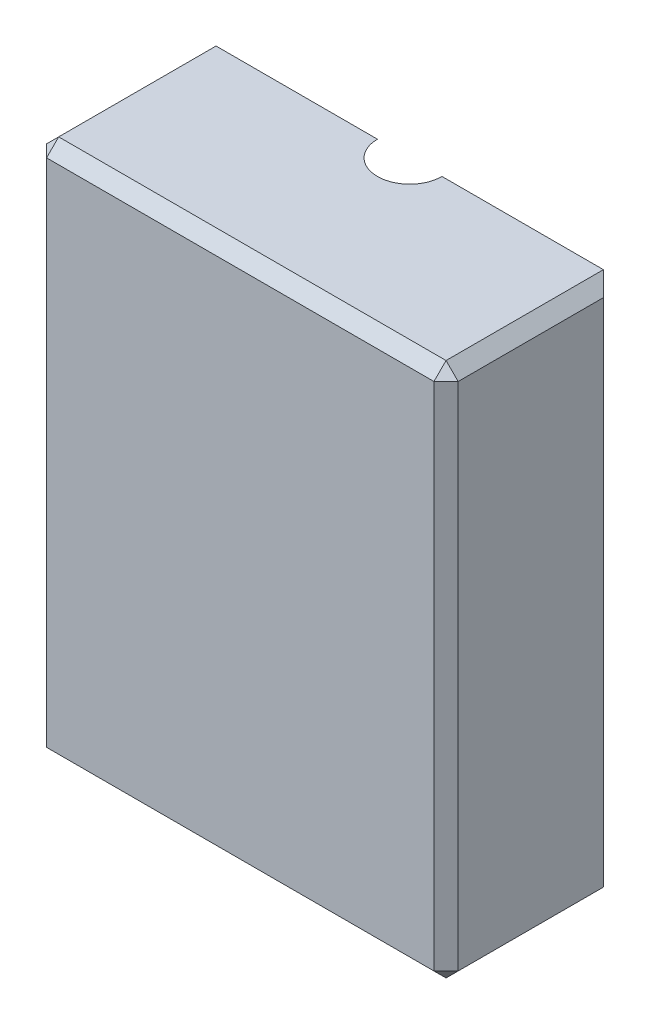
ISO-10303-21;
HEADER;
FILE_DESCRIPTION(('STEP AP214'),'2;1');
FILE_NAME('part.step','',(''),(''),'','','');
FILE_SCHEMA(('AUTOMOTIVE_DESIGN { 1 0 10303 214 1 1 1 1 }'));
ENDSEC;
DATA;
#1=APPLICATION_CONTEXT('core data for automotive mechanical design processes');
#2=APPLICATION_PROTOCOL_DEFINITION('international standard','automotive_design',2000,#1);
#3=PRODUCT_CONTEXT('',#1,'mechanical');
#4=PRODUCT('Part','Part','',(#3));
#5=PRODUCT_RELATED_PRODUCT_CATEGORY('part','',(#4));
#6=PRODUCT_DEFINITION_FORMATION('','',#4);
#7=PRODUCT_DEFINITION_CONTEXT('part definition',#1,'design');
#8=PRODUCT_DEFINITION('design','',#6,#7);
#9=PRODUCT_DEFINITION_SHAPE('','',#8);
#10=(LENGTH_UNIT() NAMED_UNIT(*) SI_UNIT(.MILLI.,.METRE.));
#11=(NAMED_UNIT(*) PLANE_ANGLE_UNIT() SI_UNIT($,.RADIAN.));
#12=(NAMED_UNIT(*) SI_UNIT($,.STERADIAN.) SOLID_ANGLE_UNIT());
#13=UNCERTAINTY_MEASURE_WITH_UNIT(LENGTH_MEASURE(1.E-05),#10,'distance_accuracy_value','');
#14=(GEOMETRIC_REPRESENTATION_CONTEXT(3) GLOBAL_UNCERTAINTY_ASSIGNED_CONTEXT((#13)) GLOBAL_UNIT_ASSIGNED_CONTEXT((#10,
#11,#12)) REPRESENTATION_CONTEXT('',''));
#15=CARTESIAN_POINT('',(0.,0.,0.));
#16=DIRECTION('',(0.,0.,1.));
#17=DIRECTION('',(1.,0.,0.));
#18=AXIS2_PLACEMENT_3D('',#15,#16,#17);
#19=CARTESIAN_POINT('',(85.,92.9352226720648,70.));
#20=DIRECTION('',(0.,-1.,0.));
#21=DIRECTION('',(1.,0.,0.));
#22=AXIS2_PLACEMENT_3D('',#19,#20,#21);
#23=PLANE('',#22);
#24=DIRECTION('',(1.,0.,0.));
#25=VECTOR('',#24,1.);
#26=CARTESIAN_POINT('',(85.,92.9352226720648,65.));
#27=LINE('',#26,#25);
#28=CARTESIAN_POINT('',(-80.,92.9352226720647,65.));
#29=VERTEX_POINT('',#28);
#30=CARTESIAN_POINT('',(80.,92.9352226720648,65.));
#31=VERTEX_POINT('',#30);
#32=EDGE_CURVE('E49',#29,#31,#27,.T.);
#33=ORIENTED_EDGE('',*,*,#32,.T.);
#34=DIRECTION('',(0.,0.,-1.));
#35=VECTOR('',#34,1.);
#36=CARTESIAN_POINT('',(80.,92.9352226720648,70.));
#37=LINE('',#36,#35);
#38=CARTESIAN_POINT('',(80.,92.9352226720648,0.));
#39=VERTEX_POINT('',#38);
#40=EDGE_CURVE('E41',#31,#39,#37,.T.);
#41=ORIENTED_EDGE('',*,*,#40,.T.);
#42=DIRECTION('',(-1.,0.,0.));
#43=VECTOR('',#42,1.);
#44=CARTESIAN_POINT('',(85.,92.9352226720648,0.));
#45=LINE('',#44,#43);
#46=CARTESIAN_POINT('',(13.3400809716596,92.9352226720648,0.));
#47=VERTEX_POINT('',#46);
#48=EDGE_CURVE('E482',#39,#47,#45,.T.);
#49=ORIENTED_EDGE('',*,*,#48,.T.);
#50=CARTESIAN_POINT('',(-3.20923843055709E-13,92.9352226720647,0.));
#51=DIRECTION('',(0.,1.,0.));
#52=DIRECTION('',(-0.964273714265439,0.,0.264907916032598));
#53=AXIS2_PLACEMENT_3D('',#50,#51,#52);
#54=CIRCLE('',#53,13.3400809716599);
#55=CARTESIAN_POINT('',(-13.3400809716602,92.9352226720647,0.));
#56=VERTEX_POINT('',#55);
#57=EDGE_CURVE('E301',#56,#47,#54,.T.);
#58=ORIENTED_EDGE('',*,*,#57,.F.);
#59=CARTESIAN_POINT('',(-80.,92.9352226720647,0.));
#60=VERTEX_POINT('',#59);
#61=EDGE_CURVE('E481',#56,#60,#45,.T.);
#62=ORIENTED_EDGE('',*,*,#61,.T.);
#63=DIRECTION('',(0.,0.,1.));
#64=VECTOR('',#63,1.);
#65=CARTESIAN_POINT('',(-80.,92.9352226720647,70.));
#66=LINE('',#65,#64);
#67=EDGE_CURVE('E54',#60,#29,#66,.T.);
#68=ORIENTED_EDGE('',*,*,#67,.T.);
#69=EDGE_LOOP('',(#33,#41,#49,#58,#62,#68));
#70=FACE_BOUND('',#69,.T.);
#71=ADVANCED_FACE('F32',(#70),#23,.F.);
#72=CARTESIAN_POINT('',(85.,-127.935222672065,70.));
#73=DIRECTION('',(0.,1.,0.));
#74=DIRECTION('',(-1.,0.,0.));
#75=AXIS2_PLACEMENT_3D('',#72,#73,#74);
#76=PLANE('',#75);
#77=DIRECTION('',(1.,0.,0.));
#78=VECTOR('',#77,1.);
#79=CARTESIAN_POINT('',(85.,-127.935222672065,0.));
#80=LINE('',#79,#78);
#81=CARTESIAN_POINT('',(23.9656477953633,-127.935222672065,0.));
#82=VERTEX_POINT('',#81);
#83=CARTESIAN_POINT('',(80.,-127.935222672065,0.));
#84=VERTEX_POINT('',#83);
#85=EDGE_CURVE('E483',#82,#84,#80,.T.);
#86=ORIENTED_EDGE('',*,*,#85,.T.);
#87=DIRECTION('',(0.,0.,1.));
#88=VECTOR('',#87,1.);
#89=CARTESIAN_POINT('',(80.,-127.935222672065,70.));
#90=LINE('',#89,#88);
#91=CARTESIAN_POINT('',(80.,-127.935222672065,65.));
#92=VERTEX_POINT('',#91);
#93=EDGE_CURVE('E395',#84,#92,#90,.T.);
#94=ORIENTED_EDGE('',*,*,#93,.T.);
#95=DIRECTION('',(-1.,0.,0.));
#96=VECTOR('',#95,1.);
#97=CARTESIAN_POINT('',(-85.,-127.935222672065,65.));
#98=LINE('',#97,#96);
#99=CARTESIAN_POINT('',(-80.,-127.935222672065,65.));
#100=VERTEX_POINT('',#99);
#101=EDGE_CURVE('E397',#92,#100,#98,.T.);
#102=ORIENTED_EDGE('',*,*,#101,.T.);
#103=DIRECTION('',(0.,0.,-1.));
#104=VECTOR('',#103,1.);
#105=CARTESIAN_POINT('',(-80.,-127.935222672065,70.));
#106=LINE('',#105,#104);
#107=CARTESIAN_POINT('',(-80.,-127.935222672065,0.));
#108=VERTEX_POINT('',#107);
#109=EDGE_CURVE('E400',#100,#108,#106,.T.);
#110=ORIENTED_EDGE('',*,*,#109,.T.);
#111=CARTESIAN_POINT('',(-23.9656477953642,-127.935222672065,0.));
#112=VERTEX_POINT('',#111);
#113=EDGE_CURVE('E484',#108,#112,#80,.T.);
#114=ORIENTED_EDGE('',*,*,#113,.T.);
#115=CARTESIAN_POINT('',(-4.49293380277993E-13,-127.935222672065,0.));
#116=DIRECTION('',(0.,-1.,0.));
#117=DIRECTION('',(0.964273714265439,0.,-0.264907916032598));
#118=AXIS2_PLACEMENT_3D('',#115,#116,#117);
#119=CIRCLE('',#118,23.9656477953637);
#120=EDGE_CURVE('E309',#82,#112,#119,.T.);
#121=ORIENTED_EDGE('',*,*,#120,.F.);
#122=EDGE_LOOP('',(#86,#94,#102,#110,#114,#121));
#123=FACE_BOUND('',#122,.T.);
#124=ADVANCED_FACE('F490',(#123),#76,.F.);
#125=CARTESIAN_POINT('',(85.,92.9352226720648,0.));
#126=DIRECTION('',(0.,0.,1.));
#127=DIRECTION('',(1.,0.,0.));
#128=AXIS2_PLACEMENT_3D('',#125,#126,#127);
#129=PLANE('',#128);
#130=CARTESIAN_POINT('',(55.1779259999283,-17.1461572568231,0.));
#131=DIRECTION('',(0.,0.,1.));
#132=DIRECTION('',(1.,0.,0.));
#133=AXIS2_PLACEMENT_3D('',#130,#131,#132);
#134=CIRCLE('',#133,3.);
#135=CARTESIAN_POINT('',(58.1779259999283,-17.1461572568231,0.));
#136=VERTEX_POINT('',#135);
#137=EDGE_CURVE('E204',#136,#136,#134,.T.);
#138=ORIENTED_EDGE('',*,*,#137,.T.);
#139=EDGE_LOOP('',(#138));
#140=FACE_BOUND('',#139,.T.);
#141=ORIENTED_EDGE('',*,*,#48,.F.);
#142=DIRECTION('',(0.,-1.,0.));
#143=VECTOR('',#142,1.);
#144=CARTESIAN_POINT('',(80.,92.9352226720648,0.));
#145=LINE('',#144,#143);
#146=EDGE_CURVE('E375',#39,#84,#145,.T.);
#147=ORIENTED_EDGE('',*,*,#146,.T.);
#148=ORIENTED_EDGE('',*,*,#85,.F.);
#149=DIRECTION('',(0.0871557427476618,0.996194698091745,0.));
#150=VECTOR('',#149,1.);
#151=CARTESIAN_POINT('',(-1.40334292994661E-12,-401.863830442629,0.));
#152=LINE('',#151,#150);
#153=CARTESIAN_POINT('',(28.3400809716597,-77.9352226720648,0.));
#154=VERTEX_POINT('',#153);
#155=EDGE_CURVE('E425',#154,#82,#152,.F.);
#156=ORIENTED_EDGE('',*,*,#155,.F.);
#157=DIRECTION('',(0.,-1.,0.));
#158=VECTOR('',#157,1.);
#159=CARTESIAN_POINT('',(28.3400809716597,-49.5951417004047,0.));
#160=LINE('',#159,#158);
#161=CARTESIAN_POINT('',(28.3400809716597,-52.6315789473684,0.));
#162=VERTEX_POINT('',#161);
#163=EDGE_CURVE('E427',#154,#162,#160,.F.);
#164=ORIENTED_EDGE('',*,*,#163,.T.);
#165=CARTESIAN_POINT('',(31.3765182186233,-52.6315789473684,0.));
#166=DIRECTION('',(0.,0.,1.));
#167=DIRECTION('',(1.,0.,0.));
#168=AXIS2_PLACEMENT_3D('',#165,#166,#167);
#169=CIRCLE('',#168,3.03643724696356);
#170=CARTESIAN_POINT('',(31.3765182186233,-49.5951417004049,0.));
#171=VERTEX_POINT('',#170);
#172=EDGE_CURVE('E430',#171,#162,#169,.T.);
#173=ORIENTED_EDGE('',*,*,#172,.F.);
#174=DIRECTION('',(0.998629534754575,0.0523359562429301,0.));
#175=VECTOR('',#174,1.);
#176=CARTESIAN_POINT('',(-1.79221398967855E-13,-51.2395153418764,0.));
#177=LINE('',#176,#175);
#178=CARTESIAN_POINT('',(48.2263523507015,-48.7120793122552,0.));
#179=VERTEX_POINT('',#178);
#180=EDGE_CURVE('E433',#179,#171,#177,.F.);
#181=ORIENTED_EDGE('',*,*,#180,.F.);
#182=CARTESIAN_POINT('',(48.0693444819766,-45.7161907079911,0.));
#183=DIRECTION('',(0.,0.,1.));
#184=DIRECTION('',(1.,0.,0.));
#185=AXIS2_PLACEMENT_3D('',#182,#183,#184);
#186=CIRCLE('',#185,3.);
#187=CARTESIAN_POINT('',(51.0675169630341,-45.8208891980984,0.));
#188=VERTEX_POINT('',#187);
#189=EDGE_CURVE('E435',#179,#188,#186,.T.);
#190=ORIENTED_EDGE('',*,*,#189,.T.);
#191=DIRECTION('',(0.0348994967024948,0.999390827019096,0.));
#192=VECTOR('',#191,1.);
#193=CARTESIAN_POINT('',(5.60880223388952E-12,-1508.20323948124,0.));
#194=LINE('',#193,#192);
#195=CARTESIAN_POINT('',(54.2545733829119,45.4444656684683,0.));
#196=VERTEX_POINT('',#195);
#197=EDGE_CURVE('E221',#188,#196,#194,.T.);
#198=ORIENTED_EDGE('',*,*,#197,.T.);
#199=CARTESIAN_POINT('',(51.2564009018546,45.5491641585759,0.));
#200=DIRECTION('',(0.,0.,1.));
#201=DIRECTION('',(1.,0.,0.));
#202=AXIS2_PLACEMENT_3D('',#199,#200,#201);
#203=CIRCLE('',#202,3.);
#204=CARTESIAN_POINT('',(51.4134087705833,48.5450527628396,0.));
#205=VERTEX_POINT('',#204);
#206=EDGE_CURVE('E210',#196,#205,#203,.T.);
#207=ORIENTED_EDGE('',*,*,#206,.T.);
#208=DIRECTION('',(-0.998629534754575,0.0523359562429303,0.));
#209=VECTOR('',#208,1.);
#210=CARTESIAN_POINT('',(-1.86929983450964E-13,51.2395153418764,0.));
#211=LINE('',#210,#209);
#212=CARTESIAN_POINT('',(31.3765182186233,49.5951417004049,0.));
#213=VERTEX_POINT('',#212);
#214=EDGE_CURVE('E194',#205,#213,#211,.T.);
#215=ORIENTED_EDGE('',*,*,#214,.T.);
#216=CARTESIAN_POINT('',(31.3765182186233,52.6315789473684,0.));
#217=DIRECTION('',(0.,0.,1.));
#218=DIRECTION('',(1.,0.,0.));
#219=AXIS2_PLACEMENT_3D('',#216,#217,#218);
#220=CIRCLE('',#219,3.03643724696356);
#221=CARTESIAN_POINT('',(28.3400809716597,52.6315789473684,0.));
#222=VERTEX_POINT('',#221);
#223=EDGE_CURVE('E423',#222,#213,#220,.T.);
#224=ORIENTED_EDGE('',*,*,#223,.F.);
#225=DIRECTION('',(0.,1.,0.));
#226=VECTOR('',#225,1.);
#227=CARTESIAN_POINT('',(28.3400809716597,49.5951417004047,0.));
#228=LINE('',#227,#226);
#229=CARTESIAN_POINT('',(28.3400809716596,77.9352226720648,0.));
#230=VERTEX_POINT('',#229);
#231=EDGE_CURVE('E420',#222,#230,#228,.T.);
#232=ORIENTED_EDGE('',*,*,#231,.T.);
#233=DIRECTION('',(-0.707106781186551,0.707106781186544,0.));
#234=VECTOR('',#233,1.);
#235=CARTESIAN_POINT('',(-3.65965075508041E-13,106.275303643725,0.));
#236=LINE('',#235,#234);
#237=EDGE_CURVE('E418',#47,#230,#236,.F.);
#238=ORIENTED_EDGE('',*,*,#237,.F.);
#239=EDGE_LOOP('',(#141,#147,#148,#156,#164,#173,#181,#190,#198,#207,#215,#224,#232,#238));
#240=FACE_BOUND('',#239,.T.);
#241=ADVANCED_FACE('F219',(#140,#240),#129,.F.);
#242=CARTESIAN_POINT('',(85.,-127.935222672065,70.));
#243=DIRECTION('',(-1.,0.,0.));
#244=DIRECTION('',(0.,0.,1.));
#245=AXIS2_PLACEMENT_3D('',#242,#243,#244);
#246=PLANE('',#245);
#247=DIRECTION('',(0.,0.,1.));
#248=VECTOR('',#247,1.);
#249=CARTESIAN_POINT('',(85.,87.9352226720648,70.));
#250=LINE('',#249,#248);
#251=CARTESIAN_POINT('',(85.,87.9352226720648,4.99999999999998));
#252=VERTEX_POINT('',#251);
#253=CARTESIAN_POINT('',(85.,87.9352226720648,65.));
#254=VERTEX_POINT('',#253);
#255=EDGE_CURVE('E384',#252,#254,#250,.T.);
#256=ORIENTED_EDGE('',*,*,#255,.T.);
#257=DIRECTION('',(0.,-1.,0.));
#258=VECTOR('',#257,1.);
#259=CARTESIAN_POINT('',(85.,-127.935222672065,65.));
#260=LINE('',#259,#258);
#261=CARTESIAN_POINT('',(85.,-122.935222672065,65.));
#262=VERTEX_POINT('',#261);
#263=EDGE_CURVE('E377',#254,#262,#260,.T.);
#264=ORIENTED_EDGE('',*,*,#263,.T.);
#265=DIRECTION('',(0.,0.,-1.));
#266=VECTOR('',#265,1.);
#267=CARTESIAN_POINT('',(85.,-122.935222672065,70.));
#268=LINE('',#267,#266);
#269=CARTESIAN_POINT('',(85.,-122.935222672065,4.99999999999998));
#270=VERTEX_POINT('',#269);
#271=EDGE_CURVE('E380',#262,#270,#268,.T.);
#272=ORIENTED_EDGE('',*,*,#271,.T.);
#273=DIRECTION('',(0.,1.,0.));
#274=VECTOR('',#273,1.);
#275=CARTESIAN_POINT('',(85.,-127.935222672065,4.99999999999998));
#276=LINE('',#275,#274);
#277=EDGE_CURVE('E382',#270,#252,#276,.T.);
#278=ORIENTED_EDGE('',*,*,#277,.T.);
#279=EDGE_LOOP('',(#256,#264,#272,#278));
#280=FACE_BOUND('',#279,.T.);
#281=ADVANCED_FACE('F575',(#280),#246,.F.);
#282=CARTESIAN_POINT('',(-85.,-127.935222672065,70.));
#283=DIRECTION('',(1.,0.,0.));
#284=DIRECTION('',(0.,0.,-1.));
#285=AXIS2_PLACEMENT_3D('',#282,#283,#284);
#286=PLANE('',#285);
#287=DIRECTION('',(0.,0.,1.));
#288=VECTOR('',#287,1.);
#289=CARTESIAN_POINT('',(-85.,-122.935222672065,70.));
#290=LINE('',#289,#288);
#291=CARTESIAN_POINT('',(-85.,-122.935222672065,4.99999999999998));
#292=VERTEX_POINT('',#291);
#293=CARTESIAN_POINT('',(-85.,-122.935222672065,65.));
#294=VERTEX_POINT('',#293);
#295=EDGE_CURVE('E389',#292,#294,#290,.T.);
#296=ORIENTED_EDGE('',*,*,#295,.T.);
#297=DIRECTION('',(0.,1.,0.));
#298=VECTOR('',#297,1.);
#299=CARTESIAN_POINT('',(-85.,92.9352226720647,65.));
#300=LINE('',#299,#298);
#301=CARTESIAN_POINT('',(-85.,87.9352226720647,65.));
#302=VERTEX_POINT('',#301);
#303=EDGE_CURVE('E386',#294,#302,#300,.T.);
#304=ORIENTED_EDGE('',*,*,#303,.T.);
#305=DIRECTION('',(0.,0.,-1.));
#306=VECTOR('',#305,1.);
#307=CARTESIAN_POINT('',(-85.,87.9352226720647,70.));
#308=LINE('',#307,#306);
#309=CARTESIAN_POINT('',(-85.,87.9352226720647,4.99999999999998));
#310=VERTEX_POINT('',#309);
#311=EDGE_CURVE('E393',#302,#310,#308,.T.);
#312=ORIENTED_EDGE('',*,*,#311,.T.);
#313=DIRECTION('',(0.,-1.,0.));
#314=VECTOR('',#313,1.);
#315=CARTESIAN_POINT('',(-85.,-127.935222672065,4.99999999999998));
#316=LINE('',#315,#314);
#317=EDGE_CURVE('E391',#310,#292,#316,.T.);
#318=ORIENTED_EDGE('',*,*,#317,.T.);
#319=EDGE_LOOP('',(#296,#304,#312,#318));
#320=FACE_BOUND('',#319,.T.);
#321=ADVANCED_FACE('F536',(#320),#286,.F.);
#322=CARTESIAN_POINT('',(85.,92.9352226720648,70.));
#323=DIRECTION('',(0.,0.,1.));
#324=DIRECTION('',(1.,0.,0.));
#325=AXIS2_PLACEMENT_3D('',#322,#323,#324);
#326=PLANE('',#325);
#327=DIRECTION('',(0.,-1.,0.));
#328=VECTOR('',#327,1.);
#329=CARTESIAN_POINT('',(-80.,-127.935222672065,70.));
#330=LINE('',#329,#328);
#331=CARTESIAN_POINT('',(-80.,87.9352226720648,70.));
#332=VERTEX_POINT('',#331);
#333=CARTESIAN_POINT('',(-80.,-122.935222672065,70.));
#334=VERTEX_POINT('',#333);
#335=EDGE_CURVE('E405',#332,#334,#330,.T.);
#336=ORIENTED_EDGE('',*,*,#335,.T.);
#337=DIRECTION('',(1.,0.,0.));
#338=VECTOR('',#337,1.);
#339=CARTESIAN_POINT('',(85.,-122.935222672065,70.));
#340=LINE('',#339,#338);
#341=CARTESIAN_POINT('',(80.,-122.935222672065,70.));
#342=VERTEX_POINT('',#341);
#343=EDGE_CURVE('E402',#334,#342,#340,.T.);
#344=ORIENTED_EDGE('',*,*,#343,.T.);
#345=DIRECTION('',(0.,1.,0.));
#346=VECTOR('',#345,1.);
#347=CARTESIAN_POINT('',(80.,92.9352226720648,70.));
#348=LINE('',#347,#346);
#349=CARTESIAN_POINT('',(80.,87.9352226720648,70.));
#350=VERTEX_POINT('',#349);
#351=EDGE_CURVE('E407',#342,#350,#348,.T.);
#352=ORIENTED_EDGE('',*,*,#351,.T.);
#353=DIRECTION('',(-1.,0.,0.));
#354=VECTOR('',#353,1.);
#355=CARTESIAN_POINT('',(-85.,87.9352226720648,70.));
#356=LINE('',#355,#354);
#357=EDGE_CURVE('E409',#350,#332,#356,.T.);
#358=ORIENTED_EDGE('',*,*,#357,.T.);
#359=EDGE_LOOP('',(#336,#344,#352,#358));
#360=FACE_BOUND('',#359,.T.);
#361=ADVANCED_FACE('F517',(#360),#326,.T.);
#362=ORIENTED_EDGE('',*,*,#113,.F.);
#363=DIRECTION('',(0.,1.,0.));
#364=VECTOR('',#363,1.);
#365=CARTESIAN_POINT('',(-80.,92.9352226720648,0.));
#366=LINE('',#365,#364);
#367=EDGE_CURVE('E11',#108,#60,#366,.T.);
#368=ORIENTED_EDGE('',*,*,#367,.T.);
#369=ORIENTED_EDGE('',*,*,#61,.F.);
#370=DIRECTION('',(-0.707106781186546,-0.707106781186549,0.));
#371=VECTOR('',#370,1.);
#372=CARTESIAN_POINT('',(-3.65965075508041E-13,106.275303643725,0.));
#373=LINE('',#372,#371);
#374=CARTESIAN_POINT('',(-28.3400809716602,77.9352226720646,0.));
#375=VERTEX_POINT('',#374);
#376=EDGE_CURVE('E411',#375,#56,#373,.F.);
#377=ORIENTED_EDGE('',*,*,#376,.F.);
#378=DIRECTION('',(0.,1.,0.));
#379=VECTOR('',#378,1.);
#380=CARTESIAN_POINT('',(-28.3400809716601,49.5951417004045,0.));
#381=LINE('',#380,#379);
#382=CARTESIAN_POINT('',(-28.3400809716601,52.6315789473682,0.));
#383=VERTEX_POINT('',#382);
#384=EDGE_CURVE('E413',#375,#383,#381,.F.);
#385=ORIENTED_EDGE('',*,*,#384,.T.);
#386=CARTESIAN_POINT('',(-31.3765182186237,52.6315789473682,0.));
#387=DIRECTION('',(0.,0.,1.));
#388=DIRECTION('',(1.,0.,0.));
#389=AXIS2_PLACEMENT_3D('',#386,#387,#388);
#390=CIRCLE('',#389,3.03643724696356);
#391=CARTESIAN_POINT('',(-31.3765182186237,49.5951417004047,0.));
#392=VERTEX_POINT('',#391);
#393=EDGE_CURVE('E416',#392,#383,#390,.T.);
#394=ORIENTED_EDGE('',*,*,#393,.F.);
#395=DIRECTION('',(-0.998629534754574,-0.0523359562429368,0.));
#396=VECTOR('',#395,1.);
#397=CARTESIAN_POINT('',(-1.86929983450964E-13,51.2395153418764,0.));
#398=LINE('',#397,#396);
#399=CARTESIAN_POINT('',(-48.9281422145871,48.6753000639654,0.));
#400=VERTEX_POINT('',#399);
#401=EDGE_CURVE('E205',#392,#400,#398,.T.);
#402=ORIENTED_EDGE('',*,*,#401,.T.);
#403=CARTESIAN_POINT('',(-51.9184688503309,48.9160210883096,0.));
#404=DIRECTION('',(0.,0.,1.));
#405=DIRECTION('',(1.,0.,0.));
#406=AXIS2_PLACEMENT_3D('',#403,#404,#405);
#407=CIRCLE('',#406,3.);
#408=CARTESIAN_POINT('',(-54.0021832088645,46.7577499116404,0.));
#409=VERTEX_POINT('',#408);
#410=EDGE_CURVE('E462',#400,#409,#407,.T.);
#411=ORIENTED_EDGE('',*,*,#410,.T.);
#412=CARTESIAN_POINT('',(-51.2564009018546,45.5491641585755,0.));
#413=DIRECTION('',(0.,0.,1.));
#414=DIRECTION('',(1.,0.,0.));
#415=AXIS2_PLACEMENT_3D('',#412,#413,#414);
#416=CIRCLE('',#415,3.);
#417=CARTESIAN_POINT('',(-54.2545733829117,45.4444656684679,0.));
#418=VERTEX_POINT('',#417);
#419=EDGE_CURVE('E223',#409,#418,#416,.T.);
#420=ORIENTED_EDGE('',*,*,#419,.T.);
#421=DIRECTION('',(0.0348994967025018,-0.999390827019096,0.));
#422=VECTOR('',#421,1.);
#423=CARTESIAN_POINT('',(5.60880223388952E-12,-1508.20323948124,0.));
#424=LINE('',#423,#422);
#425=CARTESIAN_POINT('',(-51.0675169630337,-45.8208891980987,0.));
#426=VERTEX_POINT('',#425);
#427=EDGE_CURVE('E444',#418,#426,#424,.T.);
#428=ORIENTED_EDGE('',*,*,#427,.T.);
#429=CARTESIAN_POINT('',(-48.0693444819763,-45.7161907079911,0.));
#430=DIRECTION('',(0.,0.,1.));
#431=DIRECTION('',(1.,0.,0.));
#432=AXIS2_PLACEMENT_3D('',#429,#430,#431);
#433=CIRCLE('',#432,3.);
#434=CARTESIAN_POINT('',(-48.2263523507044,-48.7120793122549,0.));
#435=VERTEX_POINT('',#434);
#436=EDGE_CURVE('E256',#426,#435,#433,.T.);
#437=ORIENTED_EDGE('',*,*,#436,.T.);
#438=DIRECTION('',(0.998629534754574,-0.052335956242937,0.));
#439=VECTOR('',#438,1.);
#440=CARTESIAN_POINT('',(-1.79221398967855E-13,-51.2395153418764,0.));
#441=LINE('',#440,#439);
#442=CARTESIAN_POINT('',(-31.3765182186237,-49.5951417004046,0.));
#443=VERTEX_POINT('',#442);
#444=EDGE_CURVE('E446',#443,#435,#441,.F.);
#445=ORIENTED_EDGE('',*,*,#444,.F.);
#446=CARTESIAN_POINT('',(-31.3765182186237,-52.6315789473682,0.));
#447=DIRECTION('',(0.,0.,1.));
#448=DIRECTION('',(1.,0.,0.));
#449=AXIS2_PLACEMENT_3D('',#446,#447,#448);
#450=CIRCLE('',#449,3.03643724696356);
#451=CARTESIAN_POINT('',(-28.3400809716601,-52.6315789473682,0.));
#452=VERTEX_POINT('',#451);
#453=EDGE_CURVE('E442',#452,#443,#450,.T.);
#454=ORIENTED_EDGE('',*,*,#453,.F.);
#455=DIRECTION('',(0.,-1.,0.));
#456=VECTOR('',#455,1.);
#457=CARTESIAN_POINT('',(-28.3400809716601,-49.5951417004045,0.));
#458=LINE('',#457,#456);
#459=CARTESIAN_POINT('',(-28.3400809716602,-77.9352226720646,0.));
#460=VERTEX_POINT('',#459);
#461=EDGE_CURVE('E439',#452,#460,#458,.T.);
#462=ORIENTED_EDGE('',*,*,#461,.T.);
#463=DIRECTION('',(0.0871557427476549,-0.996194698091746,0.));
#464=VECTOR('',#463,1.);
#465=CARTESIAN_POINT('',(-1.40334292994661E-12,-401.863830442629,0.));
#466=LINE('',#465,#464);
#467=EDGE_CURVE('E437',#112,#460,#466,.F.);
#468=ORIENTED_EDGE('',*,*,#467,.F.);
#469=EDGE_LOOP('',(#362,#368,#369,#377,#385,#394,#402,#411,#420,#428,#437,#445,#454,#462,#468));
#470=FACE_BOUND('',#469,.T.);
#471=CARTESIAN_POINT('',(-51.9184688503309,-61.9636703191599,0.));
#472=DIRECTION('',(0.,0.,1.));
#473=DIRECTION('',(1.,0.,0.));
#474=AXIS2_PLACEMENT_3D('',#471,#472,#473);
#475=CIRCLE('',#474,3.);
#476=CARTESIAN_POINT('',(-48.9184688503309,-61.9636703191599,0.));
#477=VERTEX_POINT('',#476);
#478=EDGE_CURVE('E470',#477,#477,#475,.T.);
#479=ORIENTED_EDGE('',*,*,#478,.T.);
#480=EDGE_LOOP('',(#479));
#481=FACE_BOUND('',#480,.T.);
#482=ADVANCED_FACE('F453',(#470,#481),#129,.F.);
#483=CARTESIAN_POINT('',(-51.9184688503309,-61.9636703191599,0.));
#484=DIRECTION('',(0.,0.,1.));
#485=DIRECTION('',(1.,0.,0.));
#486=AXIS2_PLACEMENT_3D('',#483,#484,#485);
#487=CONICAL_SURFACE('',#486,3.,0.174532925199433);
#488=CARTESIAN_POINT('',(-51.9184688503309,-61.9636703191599,-5.));
#489=DIRECTION('',(0.,0.,1.));
#490=DIRECTION('',(1.,0.,0.));
#491=AXIS2_PLACEMENT_3D('',#488,#489,#490);
#492=CIRCLE('',#491,2.11836509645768);
#493=CARTESIAN_POINT('',(-49.8001037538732,-61.9636703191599,-5.));
#494=VERTEX_POINT('',#493);
#495=EDGE_CURVE('E478',#494,#494,#492,.T.);
#496=ORIENTED_EDGE('',*,*,#495,.T.);
#497=EDGE_LOOP('',(#496));
#498=FACE_BOUND('',#497,.T.);
#499=ORIENTED_EDGE('',*,*,#478,.F.);
#500=EDGE_LOOP('',(#499));
#501=FACE_BOUND('',#500,.T.);
#502=ADVANCED_FACE('F704',(#498,#501),#487,.T.);
#503=CARTESIAN_POINT('',(-51.9184688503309,-61.9636703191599,-5.));
#504=DIRECTION('',(0.,0.,1.));
#505=DIRECTION('',(1.,0.,0.));
#506=AXIS2_PLACEMENT_3D('',#503,#504,#505);
#507=PLANE('',#506);
#508=ORIENTED_EDGE('',*,*,#495,.F.);
#509=EDGE_LOOP('',(#508));
#510=FACE_BOUND('',#509,.T.);
#511=ADVANCED_FACE('F684',(#510),#507,.F.);
#512=CARTESIAN_POINT('',(-51.9184688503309,48.9160210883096,0.));
#513=DIRECTION('',(0.,0.,1.));
#514=DIRECTION('',(1.,0.,0.));
#515=AXIS2_PLACEMENT_3D('',#512,#513,#514);
#516=CONICAL_SURFACE('',#515,3.,0.174532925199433);
#517=CARTESIAN_POINT('',(-49.8215844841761,48.6153597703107,-5.0002));
#518=CARTESIAN_POINT('',(-49.7149084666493,48.6240215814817,-4.40815655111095));
#519=CARTESIAN_POINT('',(-49.6086420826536,48.6321358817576,-3.81603143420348));
#520=CARTESIAN_POINT('',(-49.3967024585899,48.6472530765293,-2.63166261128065));
#521=CARTESIAN_POINT('',(-49.291029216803,48.6542559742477,-2.03941890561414));
#522=CARTESIAN_POINT('',(-49.1425776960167,48.6633173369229,-1.20592585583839));
#523=CARTESIAN_POINT('',(-49.0996466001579,48.6658461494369,-0.964708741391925));
#524=CARTESIAN_POINT('',(-49.0138381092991,48.6707155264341,-0.482262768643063));
#525=CARTESIAN_POINT('',(-48.9709607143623,48.673056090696,-0.241033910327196));
#526=CARTESIAN_POINT('',(-48.9281066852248,48.675301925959,0.000200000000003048));
#527=B_SPLINE_CURVE_WITH_KNOTS('',3,(#517,#518,#519,#520,#521,#522,#523,#524,#525,#526),
.UNSPECIFIED.,.F.,.F.,(4,2,2,2,4),(0.,1.80491834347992,3.60983145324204,4.34489365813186,
5.07995672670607),.UNSPECIFIED.);
#528=CARTESIAN_POINT('',(-49.8215484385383,48.6153626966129,-5.));
#529=VERTEX_POINT('',#528);
#530=EDGE_CURVE('E222',#529,#400,#527,.T.);
#531=ORIENTED_EDGE('',*,*,#530,.F.);
#532=CARTESIAN_POINT('',(-51.9184688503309,48.9160210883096,-5.));
#533=DIRECTION('',(0.,0.,1.));
#534=DIRECTION('',(1.,0.,0.));
#535=AXIS2_PLACEMENT_3D('',#532,#533,#534);
#536=CIRCLE('',#535,2.11836509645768);
#537=CARTESIAN_POINT('',(-53.3899467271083,47.3921367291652,-5.));
#538=VERTEX_POINT('',#537);
#539=EDGE_CURVE('E466',#529,#538,#536,.T.);
#540=ORIENTED_EDGE('',*,*,#539,.T.);
#541=CARTESIAN_POINT('',(-54.0021983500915,46.7577155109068,0.000200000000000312));
#542=CARTESIAN_POINT('',(-53.9864365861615,46.7935241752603,-0.207961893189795));
#543=CARTESIAN_POINT('',(-53.969202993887,46.8280501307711,-0.4162260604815));
#544=CARTESIAN_POINT('',(-53.9320099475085,46.8945982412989,-0.832902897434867));
#545=CARTESIAN_POINT('',(-53.91205060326,46.9266204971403,-1.04131556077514));
#546=CARTESIAN_POINT('',(-53.8484464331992,47.018973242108,-1.6663447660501));
#547=CARTESIAN_POINT('',(-53.8010465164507,47.0756534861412,-2.08312477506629));
#548=CARTESIAN_POINT('',(-53.6975897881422,47.1800739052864,-2.91665204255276));
#549=CARTESIAN_POINT('',(-53.6415341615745,47.2278153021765,-3.33339929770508));
#550=CARTESIAN_POINT('',(-53.5515571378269,47.2935763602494,-3.95846274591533));
#551=CARTESIAN_POINT('',(-53.5205671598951,47.3145297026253,-4.16690204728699));
#552=CARTESIAN_POINT('',(-53.4566692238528,47.3546439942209,-4.5836543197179));
#553=CARTESIAN_POINT('',(-53.4237613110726,47.3738049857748,-4.79196729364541));
#554=CARTESIAN_POINT('',(-53.3899142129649,47.3921543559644,-5.00019999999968));
#555=B_SPLINE_CURVE_WITH_KNOTS('',3,(#541,#542,#543,#544,#545,#546,#547,#548,#549,#550,#551,
#552,#553,#554),.UNSPECIFIED.,.F.,.F.,(4,2,2,2,2,2,4),(0.,0.635399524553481,1.27077344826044,
2.54038554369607,3.80982397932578,4.4451189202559,5.08039885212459),.UNSPECIFIED.);
#556=EDGE_CURVE('E227',#409,#538,#555,.T.);
#557=ORIENTED_EDGE('',*,*,#556,.F.);
#558=ORIENTED_EDGE('',*,*,#410,.F.);
#559=EDGE_LOOP('',(#531,#540,#557,#558));
#560=FACE_BOUND('',#559,.T.);
#561=ADVANCED_FACE('F236',(#560),#516,.T.);
#562=CARTESIAN_POINT('',(-51.9184688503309,48.9160210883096,-5.));
#563=DIRECTION('',(0.,0.,1.));
#564=DIRECTION('',(1.,0.,0.));
#565=AXIS2_PLACEMENT_3D('',#562,#563,#564);
#566=PLANE('',#565);
#567=ORIENTED_EDGE('',*,*,#539,.F.);
#568=CARTESIAN_POINT('',(-47.4731345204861,48.7377925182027,-5.));
#569=CARTESIAN_POINT('',(-48.7147493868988,48.6730766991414,-5.));
#570=CARTESIAN_POINT('',(-49.9563630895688,48.6083385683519,-5.));
#571=CARTESIAN_POINT('',(-52.439588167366,48.4788176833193,-5.));
#572=CARTESIAN_POINT('',(-53.6811995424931,48.4140349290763,-5.));
#573=CARTESIAN_POINT('',(-54.9228097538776,48.3492298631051,-5.));
#574=B_SPLINE_CURVE_WITH_KNOTS('',3,(#568,#569,#570,#571,#572,#573),.UNSPECIFIED.,.F.,.F.,(4,2,
4),(0.,3.72990087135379,7.45980174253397),.UNSPECIFIED.);
#575=CARTESIAN_POINT('',(-51.169703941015,48.5450527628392,-5.));
#576=VERTEX_POINT('',#575);
#577=EDGE_CURVE('E250',#529,#576,#574,.T.);
#578=ORIENTED_EDGE('',*,*,#577,.T.);
#579=CARTESIAN_POINT('',(-53.5058108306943,47.2335294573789,-5.));
#580=CARTESIAN_POINT('',(-53.6004437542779,47.0946455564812,-5.));
#581=CARTESIAN_POINT('',(-53.6834425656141,46.9476897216,-5.));
#582=CARTESIAN_POINT('',(-53.8236679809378,46.6418131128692,-5.));
#583=CARTESIAN_POINT('',(-53.8808646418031,46.482878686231,-5.));
#584=CARTESIAN_POINT('',(-53.9677179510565,46.1577011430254,-5.));
#585=CARTESIAN_POINT('',(-53.9973848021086,45.9914607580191,-5.));
#586=CARTESIAN_POINT('',(-54.0283329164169,45.6564022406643,-5.));
#587=CARTESIAN_POINT('',(-54.0296210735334,45.4875847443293,-5.));
#588=CARTESIAN_POINT('',(-54.0038128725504,45.1523590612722,-5.));
#589=CARTESIAN_POINT('',(-53.9767541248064,44.9859479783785,-5.));
#590=CARTESIAN_POINT('',(-53.8950943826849,44.6600219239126,-5.));
#591=CARTESIAN_POINT('',(-53.8404924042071,44.5005071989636,-5.));
#592=CARTESIAN_POINT('',(-53.705293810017,44.1928122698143,-5.));
#593=CARTESIAN_POINT('',(-53.6246845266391,44.0446376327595,-5.));
#594=CARTESIAN_POINT('',(-53.439802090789,43.7638733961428,-5.));
#595=CARTESIAN_POINT('',(-53.3355286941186,43.6312839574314,-5.));
#596=CARTESIAN_POINT('',(-53.1059673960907,43.3850302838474,-5.));
#597=CARTESIAN_POINT('',(-52.9806194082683,43.2714220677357,-5.));
#598=CARTESIAN_POINT('',(-52.7126989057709,43.066756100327,-5.));
#599=CARTESIAN_POINT('',(-52.5701260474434,42.9756987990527,-5.));
#600=CARTESIAN_POINT('',(-52.2711578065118,42.8183081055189,-5.));
#601=CARTESIAN_POINT('',(-52.114706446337,42.752081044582,-5.));
#602=CARTESIAN_POINT('',(-51.792933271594,42.6467161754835,-5.));
#603=CARTESIAN_POINT('',(-51.6276112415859,42.6075790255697,-5.));
#604=CARTESIAN_POINT('',(-51.2920936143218,42.5573615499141,-5.));
#605=CARTESIAN_POINT('',(-51.1218814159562,42.5463921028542,-5.));
#606=CARTESIAN_POINT('',(-50.7820238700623,42.5531246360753,-5.));
#607=CARTESIAN_POINT('',(-50.6123785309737,42.5708270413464,-5.));
#608=CARTESIAN_POINT('',(-50.2781290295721,42.6344715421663,-5.));
#609=CARTESIAN_POINT('',(-50.1135352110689,42.6804679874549,-5.));
#610=CARTESIAN_POINT('',(-49.7944177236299,42.7994709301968,-5.));
#611=CARTESIAN_POINT('',(-49.6398940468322,42.8724774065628,-5.));
#612=CARTESIAN_POINT('',(-49.3455103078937,43.0433692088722,-5.));
#613=CARTESIAN_POINT('',(-49.205633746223,43.1412261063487,-5.));
#614=CARTESIAN_POINT('',(-48.9443776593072,43.3591209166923,-5.));
#615=CARTESIAN_POINT('',(-48.8229977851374,43.4791584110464,-5.));
#616=CARTESIAN_POINT('',(-48.6027096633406,43.7375086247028,-5.));
#617=CARTESIAN_POINT('',(-48.5037141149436,43.8757468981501,-5.));
#618=CARTESIAN_POINT('',(-48.3304763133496,44.1669502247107,-5.));
#619=CARTESIAN_POINT('',(-48.2562333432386,44.3199148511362,-5.));
#620=CARTESIAN_POINT('',(-48.1350016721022,44.6353914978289,-5.));
#621=CARTESIAN_POINT('',(-48.0878759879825,44.7978508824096,-5.));
#622=CARTESIAN_POINT('',(-48.0216830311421,45.1283878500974,-5.));
#623=CARTESIAN_POINT('',(-48.0026150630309,45.2964652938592,-5.));
#624=CARTESIAN_POINT('',(-47.9931180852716,45.6327962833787,-5.));
#625=CARTESIAN_POINT('',(-48.00258234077,45.8010468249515,-5.));
#626=CARTESIAN_POINT('',(-48.0496390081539,46.1335655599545,-5.));
#627=CARTESIAN_POINT('',(-48.0872312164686,46.2978337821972,-5.));
#628=CARTESIAN_POINT('',(-48.1894184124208,46.6176598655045,-5.));
#629=CARTESIAN_POINT('',(-48.2540012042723,46.7732216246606,-5.));
#630=CARTESIAN_POINT('',(-48.4082897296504,47.0713405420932,-5.));
#631=CARTESIAN_POINT('',(-48.4979957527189,47.2138975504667,-5.));
#632=CARTESIAN_POINT('',(-48.7002564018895,47.4824416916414,-5.));
#633=CARTESIAN_POINT('',(-48.8128799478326,47.6083769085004,-5.));
#634=CARTESIAN_POINT('',(-49.0575774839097,47.8396680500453,-5.));
#635=CARTESIAN_POINT('',(-49.1896520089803,47.9450234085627,-5.));
#636=CARTESIAN_POINT('',(-49.4702044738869,48.132721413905,-5.));
#637=CARTESIAN_POINT('',(-49.6187607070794,48.2149470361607,-5.));
#638=CARTESIAN_POINT('',(-49.9275243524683,48.3534193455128,-5.));
#639=CARTESIAN_POINT('',(-50.087732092,48.4096653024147,-5.));
#640=CARTESIAN_POINT('',(-50.4160229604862,48.4948237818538,-5.));
#641=CARTESIAN_POINT('',(-50.5841381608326,48.523612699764,-5.));
#642=CARTESIAN_POINT('',(-50.9228103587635,48.5526186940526,-5.));
#643=CARTESIAN_POINT('',(-51.0933672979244,48.5528364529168,-5.));
#644=CARTESIAN_POINT('',(-51.432424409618,48.5246625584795,-5.));
#645=CARTESIAN_POINT('',(-51.6009201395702,48.4962174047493,-5.));
#646=CARTESIAN_POINT('',(-51.9307801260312,48.4113996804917,-5.));
#647=CARTESIAN_POINT('',(-52.092142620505,48.3550202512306,-5.));
#648=CARTESIAN_POINT('',(-52.4029547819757,48.2159576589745,-5.));
#649=CARTESIAN_POINT('',(-52.5524126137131,48.1332927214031,-5.));
#650=CARTESIAN_POINT('',(-52.8351220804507,47.9440079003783,-5.));
#651=CARTESIAN_POINT('',(-52.9683932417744,47.8374173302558,-5.));
#652=CARTESIAN_POINT('',(-53.1690811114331,47.6469357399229,-5.));
#653=CARTESIAN_POINT('',(-53.2425656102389,47.5693295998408,-5.));
#654=CARTESIAN_POINT('',(-53.3808690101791,47.4067448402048,-5.));
#655=CARTESIAN_POINT('',(-53.4456879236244,47.321766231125,-5.));
#656=CARTESIAN_POINT('',(-53.5058108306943,47.2335294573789,-5.));
#657=B_SPLINE_CURVE_WITH_KNOTS('',3,(#579,#580,#581,#582,#583,#584,#585,#586,#587,#588,#589,
#590,#591,#592,#593,#594,#595,#596,#597,#598,#599,#600,#601,#602,#603,#604,#605,#606,#607,#608,
#609,#610,#611,#612,#613,#614,#615,#616,#617,#618,#619,#620,#621,#622,#623,#624,#625,#626,#627,
#628,#629,#630,#631,#632,#633,#634,#635,#636,#637,#638,#639,#640,#641,#642,#643,#644,#645,#646,
#647,#648,#649,#650,#651,#652,#653,#654,#655,#656),.UNSPECIFIED.,.T.,.F.,(4,2,2,2,2,2,2,2,2,2,2,
2,2,2,2,2,2,2,2,2,2,2,2,2,2,2,2,2,2,2,2,2,2,2,2,2,2,2,4),(0.,0.503791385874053,1.00816592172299,
1.51235345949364,2.01641851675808,2.5198156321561,3.02323073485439,3.5268914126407,
4.03055728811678,4.53568432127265,5.04082143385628,5.54809765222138,6.05538619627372,
6.56466857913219,7.0739585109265,7.58422980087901,8.09450069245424,8.60419045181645,
9.11387059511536,9.62152727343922,10.1291692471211,10.634223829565,11.1392658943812,
11.6424210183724,12.1455725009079,12.64849687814,13.1514270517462,13.6558926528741,
14.1603721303,14.6673598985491,15.1743619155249,15.6836357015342,16.1928973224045,
16.7031112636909,17.2134505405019,17.7234367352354,18.2328014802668,18.5528745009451,
18.8729470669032),.UNSPECIFIED.);
#658=EDGE_CURVE('E213',#576,#538,#657,.T.);
#659=ORIENTED_EDGE('',*,*,#658,.T.);
#660=EDGE_LOOP('',(#567,#578,#659));
#661=FACE_BOUND('',#660,.T.);
#662=ADVANCED_FACE('F262',(#661),#566,.F.);
#663=CARTESIAN_POINT('',(55.1779259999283,-17.1461572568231,0.));
#664=DIRECTION('',(0.,0.,1.));
#665=DIRECTION('',(1.,0.,0.));
#666=AXIS2_PLACEMENT_3D('',#663,#664,#665);
#667=CONICAL_SURFACE('',#666,3.,0.174532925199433);
#668=CARTESIAN_POINT('',(55.1779259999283,-17.1461572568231,-5.));
#669=DIRECTION('',(0.,0.,1.));
#670=DIRECTION('',(1.,0.,0.));
#671=AXIS2_PLACEMENT_3D('',#668,#669,#670);
#672=CIRCLE('',#671,2.11836509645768);
#673=CARTESIAN_POINT('',(57.2962910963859,-17.1461572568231,-5.));
#674=VERTEX_POINT('',#673);
#675=EDGE_CURVE('E467',#674,#674,#672,.T.);
#676=ORIENTED_EDGE('',*,*,#675,.T.);
#677=EDGE_LOOP('',(#676));
#678=FACE_BOUND('',#677,.T.);
#679=ORIENTED_EDGE('',*,*,#137,.F.);
#680=EDGE_LOOP('',(#679));
#681=FACE_BOUND('',#680,.T.);
#682=ADVANCED_FACE('F266',(#678,#681),#667,.T.);
#683=CARTESIAN_POINT('',(55.1779259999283,-17.1461572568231,-5.));
#684=DIRECTION('',(0.,0.,1.));
#685=DIRECTION('',(1.,0.,0.));
#686=AXIS2_PLACEMENT_3D('',#683,#684,#685);
#687=PLANE('',#686);
#688=ORIENTED_EDGE('',*,*,#675,.F.);
#689=EDGE_LOOP('',(#688));
#690=FACE_BOUND('',#689,.T.);
#691=ADVANCED_FACE('F271',(#690),#687,.F.);
#692=CARTESIAN_POINT('',(5.41233724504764E-13,-56.7947734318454,0.));
#693=DIRECTION('',(0.,1.,0.));
#694=DIRECTION('',(-1.,0.,0.));
#695=AXIS2_PLACEMENT_3D('',#692,#693,#694);
#696=CONICAL_SURFACE('',#695,50.6843004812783,0.0349065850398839);
#697=CARTESIAN_POINT('',(1.83880688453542E-13,-45.8208891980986,0.));
#698=DIRECTION('',(0.,1.,0.));
#699=DIRECTION('',(-0.964273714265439,0.,0.264907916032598));
#700=AXIS2_PLACEMENT_3D('',#697,#698,#699);
#701=CIRCLE('',#700,51.067516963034);
#702=EDGE_CURVE('E290',#426,#188,#701,.T.);
#703=ORIENTED_EDGE('',*,*,#702,.F.);
#704=ORIENTED_EDGE('',*,*,#427,.F.);
#705=CARTESIAN_POINT('',(1.83880688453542E-13,45.4444656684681,0.));
#706=DIRECTION('',(0.,-1.,0.));
#707=DIRECTION('',(0.964273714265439,0.,-0.264907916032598));
#708=AXIS2_PLACEMENT_3D('',#705,#706,#707);
#709=CIRCLE('',#708,54.2545733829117);
#710=EDGE_CURVE('E215',#196,#418,#709,.T.);
#711=ORIENTED_EDGE('',*,*,#710,.F.);
#712=ORIENTED_EDGE('',*,*,#197,.F.);
#713=EDGE_LOOP('',(#703,#704,#711,#712));
#714=FACE_BOUND('',#713,.T.);
#715=ADVANCED_FACE('F275',(#714),#696,.F.);
#716=CARTESIAN_POINT('',(-2.74086309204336E-13,77.9352226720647,0.));
#717=DIRECTION('',(0.,-1.,0.));
#718=DIRECTION('',(-0.964273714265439,0.,0.264907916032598));
#719=AXIS2_PLACEMENT_3D('',#716,#717,#718);
#720=CONICAL_SURFACE('',#719,28.3400809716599,0.785398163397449);
#721=ORIENTED_EDGE('',*,*,#376,.T.);
#722=ORIENTED_EDGE('',*,*,#57,.T.);
#723=ORIENTED_EDGE('',*,*,#237,.T.);
#724=CARTESIAN_POINT('',(-2.74086309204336E-13,77.9352226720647,0.));
#725=DIRECTION('',(0.,1.,0.));
#726=DIRECTION('',(-1.,0.,0.));
#727=AXIS2_PLACEMENT_3D('',#724,#725,#726);
#728=CIRCLE('',#727,28.3400809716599);
#729=EDGE_CURVE('E300',#375,#230,#728,.T.);
#730=ORIENTED_EDGE('',*,*,#729,.F.);
#731=EDGE_LOOP('',(#721,#722,#723,#730));
#732=FACE_BOUND('',#731,.T.);
#733=ADVANCED_FACE('F553',(#732),#720,.F.);
#734=CARTESIAN_POINT('',(-1.73472347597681E-13,49.5951417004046,0.));
#735=DIRECTION('',(0.,1.,0.));
#736=DIRECTION('',(-1.,0.,0.));
#737=AXIS2_PLACEMENT_3D('',#734,#735,#736);
#738=CYLINDRICAL_SURFACE('',#737,28.3400809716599);
#739=CARTESIAN_POINT('',(-1.83880688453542E-13,52.6315789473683,0.));
#740=DIRECTION('',(0.,1.,0.));
#741=DIRECTION('',(-1.,0.,0.));
#742=AXIS2_PLACEMENT_3D('',#739,#740,#741);
#743=CIRCLE('',#742,28.3400809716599);
#744=EDGE_CURVE('E296',#222,#383,#743,.F.);
#745=ORIENTED_EDGE('',*,*,#744,.T.);
#746=ORIENTED_EDGE('',*,*,#384,.F.);
#747=ORIENTED_EDGE('',*,*,#729,.T.);
#748=ORIENTED_EDGE('',*,*,#231,.F.);
#749=EDGE_LOOP('',(#745,#746,#747,#748));
#750=FACE_BOUND('',#749,.T.);
#751=ADVANCED_FACE('F556',(#750),#738,.F.);
#752=CARTESIAN_POINT('',(-1.83880688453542E-13,52.6315789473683,0.));
#753=DIRECTION('',(0.,1.,0.));
#754=DIRECTION('',(-1.,0.,0.));
#755=AXIS2_PLACEMENT_3D('',#752,#753,#754);
#756=TOROIDAL_SURFACE('',#755,31.3765182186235,3.03643724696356);
#757=ORIENTED_EDGE('',*,*,#223,.T.);
#758=CARTESIAN_POINT('',(-1.82145964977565E-13,49.5951417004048,0.));
#759=DIRECTION('',(0.,-1.,0.));
#760=DIRECTION('',(0.964273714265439,0.,-0.264907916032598));
#761=AXIS2_PLACEMENT_3D('',#758,#759,#760);
#762=CIRCLE('',#761,31.3765182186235);
#763=EDGE_CURVE('E200',#213,#392,#762,.T.);
#764=ORIENTED_EDGE('',*,*,#763,.T.);
#765=ORIENTED_EDGE('',*,*,#393,.T.);
#766=ORIENTED_EDGE('',*,*,#744,.F.);
#767=EDGE_LOOP('',(#757,#764,#765,#766));
#768=FACE_BOUND('',#767,.T.);
#769=ADVANCED_FACE('F559',(#768),#756,.T.);
#770=CARTESIAN_POINT('',(-1.73472347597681E-13,-49.5951417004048,0.));
#771=DIRECTION('',(0.,1.,0.));
#772=DIRECTION('',(-0.964273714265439,0.,0.264907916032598));
#773=AXIS2_PLACEMENT_3D('',#770,#771,#772);
#774=CONICAL_SURFACE('',#773,31.3765182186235,1.51843644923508);
#775=ORIENTED_EDGE('',*,*,#180,.T.);
#776=CARTESIAN_POINT('',(-1.73472347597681E-13,-49.5951417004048,0.));
#777=DIRECTION('',(0.,1.,0.));
#778=DIRECTION('',(-0.964273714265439,0.,0.264907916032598));
#779=AXIS2_PLACEMENT_3D('',#776,#777,#778);
#780=CIRCLE('',#779,31.3765182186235);
#781=EDGE_CURVE('E317',#443,#171,#780,.T.);
#782=ORIENTED_EDGE('',*,*,#781,.F.);
#783=ORIENTED_EDGE('',*,*,#444,.T.);
#784=CARTESIAN_POINT('',(1.85615411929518E-13,-48.712079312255,0.));
#785=DIRECTION('',(0.,1.,0.));
#786=DIRECTION('',(-0.964273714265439,0.,0.264907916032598));
#787=AXIS2_PLACEMENT_3D('',#784,#785,#786);
#788=CIRCLE('',#787,48.2263523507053);
#789=EDGE_CURVE('E214',#179,#435,#788,.F.);
#790=ORIENTED_EDGE('',*,*,#789,.F.);
#791=EDGE_LOOP('',(#775,#782,#783,#790));
#792=FACE_BOUND('',#791,.T.);
#793=ADVANCED_FACE('F245',(#792),#774,.F.);
#794=CARTESIAN_POINT('',(-2.72351585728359E-13,-77.9352226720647,0.));
#795=DIRECTION('',(0.,1.,0.));
#796=DIRECTION('',(0.964273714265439,0.,-0.264907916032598));
#797=AXIS2_PLACEMENT_3D('',#794,#795,#796);
#798=CONICAL_SURFACE('',#797,28.3400809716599,0.0872664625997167);
#799=ORIENTED_EDGE('',*,*,#155,.T.);
#800=ORIENTED_EDGE('',*,*,#120,.T.);
#801=ORIENTED_EDGE('',*,*,#467,.T.);
#802=CARTESIAN_POINT('',(-2.72351585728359E-13,-77.9352226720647,0.));
#803=DIRECTION('',(0.,-1.,0.));
#804=DIRECTION('',(0.964273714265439,0.,-0.264907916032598));
#805=AXIS2_PLACEMENT_3D('',#802,#803,#804);
#806=CIRCLE('',#805,28.3400809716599);
#807=EDGE_CURVE('E312',#154,#460,#806,.T.);
#808=ORIENTED_EDGE('',*,*,#807,.F.);
#809=EDGE_LOOP('',(#799,#800,#801,#808));
#810=FACE_BOUND('',#809,.T.);
#811=ADVANCED_FACE('F246',(#810),#798,.F.);
#812=CARTESIAN_POINT('',(-1.73472347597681E-13,-49.5951417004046,0.));
#813=DIRECTION('',(0.,-1.,0.));
#814=DIRECTION('',(-1.,0.,0.));
#815=AXIS2_PLACEMENT_3D('',#812,#813,#814);
#816=CYLINDRICAL_SURFACE('',#815,28.3400809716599);
#817=CARTESIAN_POINT('',(-1.83880688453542E-13,-52.6315789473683,0.));
#818=DIRECTION('',(0.,-1.,0.));
#819=DIRECTION('',(1.,0.,0.));
#820=AXIS2_PLACEMENT_3D('',#817,#818,#819);
#821=CIRCLE('',#820,28.3400809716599);
#822=EDGE_CURVE('E297',#452,#162,#821,.F.);
#823=ORIENTED_EDGE('',*,*,#822,.T.);
#824=ORIENTED_EDGE('',*,*,#163,.F.);
#825=ORIENTED_EDGE('',*,*,#807,.T.);
#826=ORIENTED_EDGE('',*,*,#461,.F.);
#827=EDGE_LOOP('',(#823,#824,#825,#826));
#828=FACE_BOUND('',#827,.T.);
#829=ADVANCED_FACE('F283',(#828),#816,.F.);
#830=CARTESIAN_POINT('',(-1.83880688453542E-13,-52.6315789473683,0.));
#831=DIRECTION('',(0.,-1.,0.));
#832=DIRECTION('',(1.,0.,0.));
#833=AXIS2_PLACEMENT_3D('',#830,#831,#832);
#834=TOROIDAL_SURFACE('',#833,31.3765182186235,3.03643724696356);
#835=ORIENTED_EDGE('',*,*,#453,.T.);
#836=ORIENTED_EDGE('',*,*,#781,.T.);
#837=ORIENTED_EDGE('',*,*,#172,.T.);
#838=ORIENTED_EDGE('',*,*,#822,.F.);
#839=EDGE_LOOP('',(#835,#836,#837,#838));
#840=FACE_BOUND('',#839,.T.);
#841=ADVANCED_FACE('F278',(#840),#834,.T.);
#842=CARTESIAN_POINT('',(1.83880688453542E-13,-45.7161907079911,0.));
#843=DIRECTION('',(0.,1.,0.));
#844=DIRECTION('',(0.264907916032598,0.,0.964273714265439));
#845=AXIS2_PLACEMENT_3D('',#842,#843,#844);
#846=TOROIDAL_SURFACE('',#845,48.0693444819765,3.);
#847=ORIENTED_EDGE('',*,*,#789,.T.);
#848=ORIENTED_EDGE('',*,*,#436,.F.);
#849=ORIENTED_EDGE('',*,*,#702,.T.);
#850=ORIENTED_EDGE('',*,*,#189,.F.);
#851=EDGE_LOOP('',(#847,#848,#849,#850));
#852=FACE_BOUND('',#851,.T.);
#853=ADVANCED_FACE('F244',(#852),#846,.F.);
#854=CARTESIAN_POINT('',(-1.76941794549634E-13,48.1383240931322,0.));
#855=DIRECTION('',(0.,-1.,0.));
#856=DIRECTION('',(0.964273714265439,0.,-0.264907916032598));
#857=AXIS2_PLACEMENT_3D('',#854,#855,#856);
#858=CONICAL_SURFACE('',#857,59.1742541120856,1.51843644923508);
#859=CARTESIAN_POINT('',(-1.78676518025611E-13,48.5450527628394,0.));
#860=DIRECTION('',(0.,1.,0.));
#861=DIRECTION('',(-0.964273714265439,0.,0.264907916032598));
#862=AXIS2_PLACEMENT_3D('',#859,#860,#861);
#863=CIRCLE('',#862,51.4134087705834);
#864=EDGE_CURVE('E197',#576,#205,#863,.T.);
#865=ORIENTED_EDGE('',*,*,#864,.F.);
#866=ORIENTED_EDGE('',*,*,#577,.F.);
#867=ORIENTED_EDGE('',*,*,#530,.T.);
#868=ORIENTED_EDGE('',*,*,#401,.F.);
#869=ORIENTED_EDGE('',*,*,#763,.F.);
#870=ORIENTED_EDGE('',*,*,#214,.F.);
#871=EDGE_LOOP('',(#865,#866,#867,#868,#869,#870));
#872=FACE_BOUND('',#871,.T.);
#873=ADVANCED_FACE('F196',(#872),#858,.F.);
#874=CARTESIAN_POINT('',(0.,45.5491641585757,0.));
#875=DIRECTION('',(0.,1.,0.));
#876=DIRECTION('',(-0.964273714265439,0.,0.264907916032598));
#877=AXIS2_PLACEMENT_3D('',#874,#875,#876);
#878=TOROIDAL_SURFACE('',#877,51.2564009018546,3.);
#879=ORIENTED_EDGE('',*,*,#710,.T.);
#880=ORIENTED_EDGE('',*,*,#419,.F.);
#881=ORIENTED_EDGE('',*,*,#556,.T.);
#882=ORIENTED_EDGE('',*,*,#658,.F.);
#883=ORIENTED_EDGE('',*,*,#864,.T.);
#884=ORIENTED_EDGE('',*,*,#206,.F.);
#885=EDGE_LOOP('',(#879,#880,#881,#882,#883,#884));
#886=FACE_BOUND('',#885,.T.);
#887=ADVANCED_FACE('F209',(#886),#878,.F.);
#888=CARTESIAN_POINT('',(-85.,87.9352226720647,70.));
#889=DIRECTION('',(0.707106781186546,-0.707106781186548,0.));
#890=DIRECTION('',(0.707106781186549,0.707106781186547,0.));
#891=AXIS2_PLACEMENT_3D('',#888,#889,#890);
#892=PLANE('',#891);
#893=DIRECTION('',(0.707106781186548,0.707106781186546,0.));
#894=VECTOR('',#893,1.);
#895=CARTESIAN_POINT('',(-85.,87.9352226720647,65.));
#896=LINE('',#895,#894);
#897=EDGE_CURVE('E323',#29,#302,#896,.F.);
#898=ORIENTED_EDGE('',*,*,#897,.F.);
#899=ORIENTED_EDGE('',*,*,#67,.F.);
#900=DIRECTION('',(-0.577350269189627,-0.577350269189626,0.577350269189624));
#901=VECTOR('',#900,1.);
#902=CARTESIAN_POINT('',(-106.666666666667,66.2685560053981,26.6666666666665));
#903=LINE('',#902,#901);
#904=EDGE_CURVE('E36',#310,#60,#903,.F.);
#905=ORIENTED_EDGE('',*,*,#904,.F.);
#906=ORIENTED_EDGE('',*,*,#311,.F.);
#907=EDGE_LOOP('',(#898,#899,#905,#906));
#908=FACE_BOUND('',#907,.T.);
#909=ADVANCED_FACE('F34',(#908),#892,.F.);
#910=CARTESIAN_POINT('',(85.,87.9352226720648,70.));
#911=DIRECTION('',(0.,0.707106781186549,0.707106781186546));
#912=DIRECTION('',(0.,-0.707106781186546,0.707106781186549));
#913=AXIS2_PLACEMENT_3D('',#910,#911,#912);
#914=PLANE('',#913);
#915=DIRECTION('',(0.,-0.707106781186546,0.707106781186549));
#916=VECTOR('',#915,1.);
#917=CARTESIAN_POINT('',(80.,87.9352226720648,70.));
#918=LINE('',#917,#916);
#919=EDGE_CURVE('E335',#31,#350,#918,.T.);
#920=ORIENTED_EDGE('',*,*,#919,.F.);
#921=ORIENTED_EDGE('',*,*,#32,.F.);
#922=DIRECTION('',(0.,0.707106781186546,-0.70710678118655));
#923=VECTOR('',#922,1.);
#924=CARTESIAN_POINT('',(-80.,90.4352226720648,67.5));
#925=LINE('',#924,#923);
#926=EDGE_CURVE('E329',#332,#29,#925,.T.);
#927=ORIENTED_EDGE('',*,*,#926,.F.);
#928=ORIENTED_EDGE('',*,*,#357,.F.);
#929=EDGE_LOOP('',(#920,#921,#927,#928));
#930=FACE_BOUND('',#929,.T.);
#931=ADVANCED_FACE('F541',(#930),#914,.T.);
#932=CARTESIAN_POINT('',(80.,92.9352226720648,70.));
#933=DIRECTION('',(-0.707106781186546,-0.707106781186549,0.));
#934=DIRECTION('',(0.707106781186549,-0.707106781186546,0.));
#935=AXIS2_PLACEMENT_3D('',#932,#933,#934);
#936=PLANE('',#935);
#937=DIRECTION('',(-0.577350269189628,0.577350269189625,-0.577350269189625));
#938=VECTOR('',#937,1.);
#939=CARTESIAN_POINT('',(103.333333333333,69.6018893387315,23.3333333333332));
#940=LINE('',#939,#938);
#941=EDGE_CURVE('E343',#39,#252,#940,.F.);
#942=ORIENTED_EDGE('',*,*,#941,.F.);
#943=ORIENTED_EDGE('',*,*,#40,.F.);
#944=DIRECTION('',(0.707106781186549,-0.707106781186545,0.));
#945=VECTOR('',#944,1.);
#946=CARTESIAN_POINT('',(82.5,90.4352226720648,65.));
#947=LINE('',#946,#945);
#948=EDGE_CURVE('E340',#254,#31,#947,.F.);
#949=ORIENTED_EDGE('',*,*,#948,.F.);
#950=ORIENTED_EDGE('',*,*,#255,.F.);
#951=EDGE_LOOP('',(#942,#943,#949,#950));
#952=FACE_BOUND('',#951,.T.);
#953=ADVANCED_FACE('F548',(#952),#936,.F.);
#954=CARTESIAN_POINT('',(-85.,-127.935222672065,4.99999999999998));
#955=DIRECTION('',(0.707106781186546,0.,0.707106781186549));
#956=DIRECTION('',(0.707106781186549,0.,-0.707106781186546));
#957=AXIS2_PLACEMENT_3D('',#954,#955,#956);
#958=PLANE('',#957);
#959=ORIENTED_EDGE('',*,*,#904,.T.);
#960=ORIENTED_EDGE('',*,*,#367,.F.);
#961=DIRECTION('',(-0.577350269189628,0.577350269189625,0.577350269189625));
#962=VECTOR('',#961,1.);
#963=CARTESIAN_POINT('',(-83.3333333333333,-124.601889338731,3.33333333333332));
#964=LINE('',#963,#962);
#965=EDGE_CURVE('E346',#292,#108,#964,.F.);
#966=ORIENTED_EDGE('',*,*,#965,.F.);
#967=ORIENTED_EDGE('',*,*,#317,.F.);
#968=EDGE_LOOP('',(#959,#960,#966,#967));
#969=FACE_BOUND('',#968,.T.);
#970=ADVANCED_FACE('F534',(#969),#958,.F.);
#971=CARTESIAN_POINT('',(-85.,87.9352226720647,65.));
#972=DIRECTION('',(-0.577350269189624,0.577350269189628,0.577350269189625));
#973=DIRECTION('',(0.,-0.707106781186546,0.70710678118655));
#974=AXIS2_PLACEMENT_3D('',#971,#972,#973);
#975=PLANE('',#974);
#976=ORIENTED_EDGE('',*,*,#926,.T.);
#977=ORIENTED_EDGE('',*,*,#897,.T.);
#978=DIRECTION('',(0.707106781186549,0.,0.707106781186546));
#979=VECTOR('',#978,1.);
#980=CARTESIAN_POINT('',(-85.,87.9352226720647,65.));
#981=LINE('',#980,#979);
#982=EDGE_CURVE('E349',#332,#302,#981,.F.);
#983=ORIENTED_EDGE('',*,*,#982,.F.);
#984=EDGE_LOOP('',(#976,#977,#983));
#985=FACE_BOUND('',#984,.T.);
#986=ADVANCED_FACE('F538',(#985),#975,.T.);
#987=CARTESIAN_POINT('',(80.,87.9352226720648,70.));
#988=DIRECTION('',(0.577350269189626,0.577350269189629,0.577350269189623));
#989=DIRECTION('',(-0.707106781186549,0.707106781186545,0.));
#990=AXIS2_PLACEMENT_3D('',#987,#988,#989);
#991=PLANE('',#990);
#992=ORIENTED_EDGE('',*,*,#948,.T.);
#993=ORIENTED_EDGE('',*,*,#919,.T.);
#994=DIRECTION('',(0.707106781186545,0.,-0.707106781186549));
#995=VECTOR('',#994,1.);
#996=CARTESIAN_POINT('',(80.,87.9352226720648,70.));
#997=LINE('',#996,#995);
#998=EDGE_CURVE('E351',#254,#350,#997,.F.);
#999=ORIENTED_EDGE('',*,*,#998,.F.);
#1000=EDGE_LOOP('',(#992,#993,#999));
#1001=FACE_BOUND('',#1000,.T.);
#1002=ADVANCED_FACE('F544',(#1001),#991,.T.);
#1003=CARTESIAN_POINT('',(85.,-127.935222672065,4.99999999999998));
#1004=DIRECTION('',(-0.707106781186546,0.,0.707106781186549));
#1005=DIRECTION('',(0.707106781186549,0.,0.707106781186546));
#1006=AXIS2_PLACEMENT_3D('',#1003,#1004,#1005);
#1007=PLANE('',#1006);
#1008=ORIENTED_EDGE('',*,*,#941,.T.);
#1009=ORIENTED_EDGE('',*,*,#277,.F.);
#1010=DIRECTION('',(-0.577350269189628,-0.577350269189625,-0.577350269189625));
#1011=VECTOR('',#1010,1.);
#1012=CARTESIAN_POINT('',(83.3333333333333,-124.601889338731,3.33333333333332));
#1013=LINE('',#1012,#1011);
#1014=EDGE_CURVE('E354',#84,#270,#1013,.F.);
#1015=ORIENTED_EDGE('',*,*,#1014,.F.);
#1016=ORIENTED_EDGE('',*,*,#146,.F.);
#1017=EDGE_LOOP('',(#1008,#1009,#1015,#1016));
#1018=FACE_BOUND('',#1017,.T.);
#1019=ADVANCED_FACE('F497',(#1018),#1007,.F.);
#1020=CARTESIAN_POINT('',(-80.,-127.935222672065,70.));
#1021=DIRECTION('',(0.707106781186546,0.707106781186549,0.));
#1022=DIRECTION('',(-0.707106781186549,0.707106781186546,0.));
#1023=AXIS2_PLACEMENT_3D('',#1020,#1021,#1022);
#1024=PLANE('',#1023);
#1025=ORIENTED_EDGE('',*,*,#965,.T.);
#1026=ORIENTED_EDGE('',*,*,#109,.F.);
#1027=DIRECTION('',(-0.707106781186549,0.707106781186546,0.));
#1028=VECTOR('',#1027,1.);
#1029=CARTESIAN_POINT('',(-80.,-127.935222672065,65.));
#1030=LINE('',#1029,#1028);
#1031=EDGE_CURVE('E357',#294,#100,#1030,.F.);
#1032=ORIENTED_EDGE('',*,*,#1031,.F.);
#1033=ORIENTED_EDGE('',*,*,#295,.F.);
#1034=EDGE_LOOP('',(#1025,#1026,#1032,#1033));
#1035=FACE_BOUND('',#1034,.T.);
#1036=ADVANCED_FACE('F530',(#1035),#1024,.F.);
#1037=CARTESIAN_POINT('',(-80.,92.9352226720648,70.));
#1038=DIRECTION('',(-0.707106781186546,0.,0.707106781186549));
#1039=DIRECTION('',(0.707106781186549,0.,0.707106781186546));
#1040=AXIS2_PLACEMENT_3D('',#1037,#1038,#1039);
#1041=PLANE('',#1040);
#1042=ORIENTED_EDGE('',*,*,#982,.T.);
#1043=ORIENTED_EDGE('',*,*,#303,.F.);
#1044=DIRECTION('',(-0.707106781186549,0.,-0.707106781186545));
#1045=VECTOR('',#1044,1.);
#1046=CARTESIAN_POINT('',(-82.5,-122.935222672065,67.5));
#1047=LINE('',#1046,#1045);
#1048=EDGE_CURVE('E360',#334,#294,#1047,.T.);
#1049=ORIENTED_EDGE('',*,*,#1048,.F.);
#1050=ORIENTED_EDGE('',*,*,#335,.F.);
#1051=EDGE_LOOP('',(#1042,#1043,#1049,#1050));
#1052=FACE_BOUND('',#1051,.T.);
#1053=ADVANCED_FACE('F523',(#1052),#1041,.T.);
#1054=CARTESIAN_POINT('',(80.,92.9352226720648,70.));
#1055=DIRECTION('',(0.707106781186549,0.,0.707106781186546));
#1056=DIRECTION('',(0.707106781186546,0.,-0.707106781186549));
#1057=AXIS2_PLACEMENT_3D('',#1054,#1055,#1056);
#1058=PLANE('',#1057);
#1059=ORIENTED_EDGE('',*,*,#998,.T.);
#1060=ORIENTED_EDGE('',*,*,#351,.F.);
#1061=DIRECTION('',(-0.707106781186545,0.,0.707106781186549));
#1062=VECTOR('',#1061,1.);
#1063=CARTESIAN_POINT('',(80.,-122.935222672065,70.));
#1064=LINE('',#1063,#1062);
#1065=EDGE_CURVE('E363',#262,#342,#1064,.T.);
#1066=ORIENTED_EDGE('',*,*,#1065,.F.);
#1067=ORIENTED_EDGE('',*,*,#263,.F.);
#1068=EDGE_LOOP('',(#1059,#1060,#1066,#1067));
#1069=FACE_BOUND('',#1068,.T.);
#1070=ADVANCED_FACE('F513',(#1069),#1058,.T.);
#1071=CARTESIAN_POINT('',(85.,-122.935222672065,70.));
#1072=DIRECTION('',(-0.707106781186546,0.707106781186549,0.));
#1073=DIRECTION('',(-0.707106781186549,-0.707106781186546,0.));
#1074=AXIS2_PLACEMENT_3D('',#1071,#1072,#1073);
#1075=PLANE('',#1074);
#1076=ORIENTED_EDGE('',*,*,#1014,.T.);
#1077=ORIENTED_EDGE('',*,*,#271,.F.);
#1078=DIRECTION('',(-0.707106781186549,-0.707106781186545,0.));
#1079=VECTOR('',#1078,1.);
#1080=CARTESIAN_POINT('',(82.5,-125.435222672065,65.));
#1081=LINE('',#1080,#1079);
#1082=EDGE_CURVE('E366',#92,#262,#1081,.F.);
#1083=ORIENTED_EDGE('',*,*,#1082,.F.);
#1084=ORIENTED_EDGE('',*,*,#93,.F.);
#1085=EDGE_LOOP('',(#1076,#1077,#1083,#1084));
#1086=FACE_BOUND('',#1085,.T.);
#1087=ADVANCED_FACE('F500',(#1086),#1075,.F.);
#1088=CARTESIAN_POINT('',(-80.,-127.935222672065,65.));
#1089=DIRECTION('',(-0.577350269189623,-0.577350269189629,0.577350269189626));
#1090=DIRECTION('',(0.,-0.707106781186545,-0.707106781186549));
#1091=AXIS2_PLACEMENT_3D('',#1088,#1089,#1090);
#1092=PLANE('',#1091);
#1093=ORIENTED_EDGE('',*,*,#1048,.T.);
#1094=ORIENTED_EDGE('',*,*,#1031,.T.);
#1095=DIRECTION('',(0.,0.707106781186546,0.707106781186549));
#1096=VECTOR('',#1095,1.);
#1097=CARTESIAN_POINT('',(-80.,-127.935222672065,65.));
#1098=LINE('',#1097,#1096);
#1099=EDGE_CURVE('E368',#334,#100,#1098,.F.);
#1100=ORIENTED_EDGE('',*,*,#1099,.F.);
#1101=EDGE_LOOP('',(#1093,#1094,#1100));
#1102=FACE_BOUND('',#1101,.T.);
#1103=ADVANCED_FACE('F526',(#1102),#1092,.T.);
#1104=CARTESIAN_POINT('',(80.,-122.935222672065,70.));
#1105=DIRECTION('',(0.577350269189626,-0.577350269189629,0.577350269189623));
#1106=DIRECTION('',(0.707106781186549,0.707106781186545,0.));
#1107=AXIS2_PLACEMENT_3D('',#1104,#1105,#1106);
#1108=PLANE('',#1107);
#1109=ORIENTED_EDGE('',*,*,#1082,.T.);
#1110=ORIENTED_EDGE('',*,*,#1065,.T.);
#1111=DIRECTION('',(0.,-0.707106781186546,-0.707106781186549));
#1112=VECTOR('',#1111,1.);
#1113=CARTESIAN_POINT('',(80.,-122.935222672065,70.));
#1114=LINE('',#1113,#1112);
#1115=EDGE_CURVE('E370',#92,#342,#1114,.F.);
#1116=ORIENTED_EDGE('',*,*,#1115,.F.);
#1117=EDGE_LOOP('',(#1109,#1110,#1116));
#1118=FACE_BOUND('',#1117,.T.);
#1119=ADVANCED_FACE('F509',(#1118),#1108,.T.);
#1120=CARTESIAN_POINT('',(85.,-122.935222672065,70.));
#1121=DIRECTION('',(0.,-0.707106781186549,0.707106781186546));
#1122=DIRECTION('',(0.,-0.707106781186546,-0.707106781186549));
#1123=AXIS2_PLACEMENT_3D('',#1120,#1121,#1122);
#1124=PLANE('',#1123);
#1125=ORIENTED_EDGE('',*,*,#1099,.T.);
#1126=ORIENTED_EDGE('',*,*,#101,.F.);
#1127=ORIENTED_EDGE('',*,*,#1115,.T.);
#1128=ORIENTED_EDGE('',*,*,#343,.F.);
#1129=EDGE_LOOP('',(#1125,#1126,#1127,#1128));
#1130=FACE_BOUND('',#1129,.T.);
#1131=ADVANCED_FACE('F506',(#1130),#1124,.T.);
#1132=CLOSED_SHELL('',(#71,#124,#241,#281,#321,#361,#482,#502,#511,#561,#662,#682,#691,#715,
#733,#751,#769,#793,#811,#829,#841,#853,#873,#887,#909,#931,#953,#970,#986,#1002,#1019,#1036,
#1053,#1070,#1087,#1103,#1119,#1131));
#1133=MANIFOLD_SOLID_BREP('B2',#1132);
#1134=ADVANCED_BREP_SHAPE_REPRESENTATION('',(#18,#1133),#14);
#1135=SHAPE_DEFINITION_REPRESENTATION(#9,#1134);
ENDSEC;
END-ISO-10303-21;
